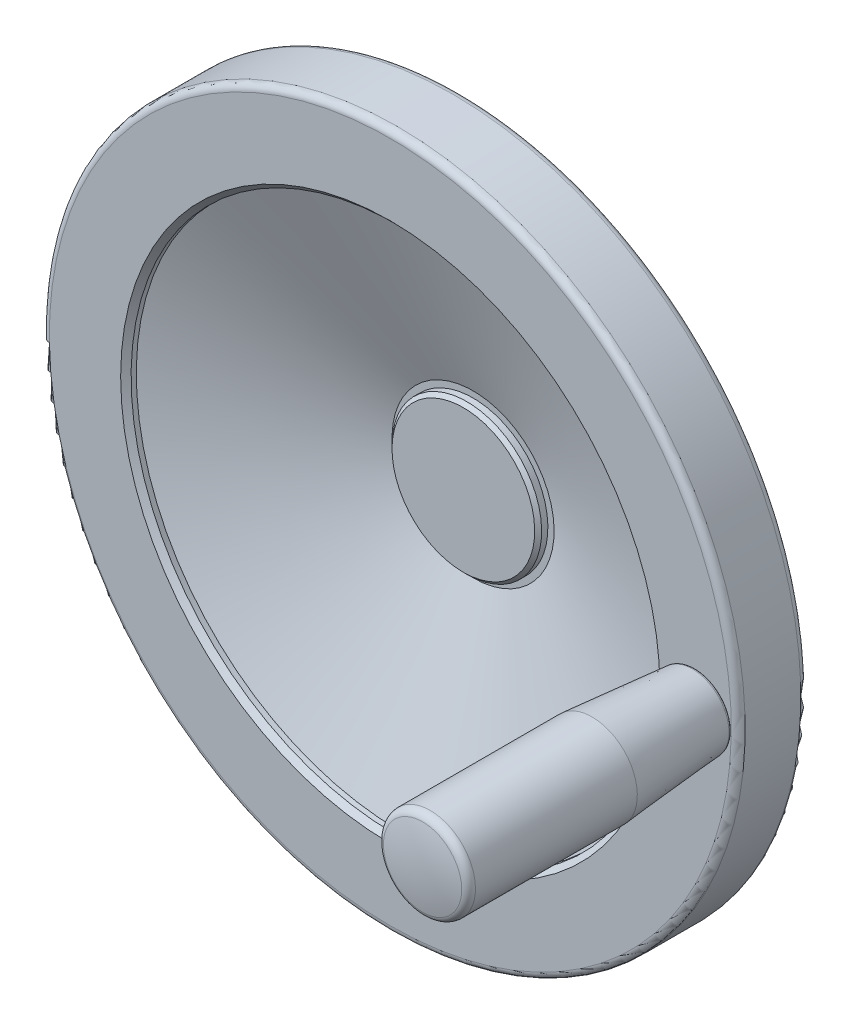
ISO-10303-21;
HEADER;
FILE_DESCRIPTION(('STEP AP214'),'2;1');
FILE_NAME('part.step','',(''),(''),'','','');
FILE_SCHEMA(('AUTOMOTIVE_DESIGN { 1 0 10303 214 1 1 1 1 }'));
ENDSEC;
DATA;
#1=APPLICATION_CONTEXT('core data for automotive mechanical design processes');
#2=APPLICATION_PROTOCOL_DEFINITION('international standard','automotive_design',2000,#1);
#3=PRODUCT_CONTEXT('',#1,'mechanical');
#4=PRODUCT('Part','Part','',(#3));
#5=PRODUCT_RELATED_PRODUCT_CATEGORY('part','',(#4));
#6=PRODUCT_DEFINITION_FORMATION('','',#4);
#7=PRODUCT_DEFINITION_CONTEXT('part definition',#1,'design');
#8=PRODUCT_DEFINITION('design','',#6,#7);
#9=PRODUCT_DEFINITION_SHAPE('','',#8);
#10=(LENGTH_UNIT() NAMED_UNIT(*) SI_UNIT(.MILLI.,.METRE.));
#11=(NAMED_UNIT(*) PLANE_ANGLE_UNIT() SI_UNIT($,.RADIAN.));
#12=(NAMED_UNIT(*) SI_UNIT($,.STERADIAN.) SOLID_ANGLE_UNIT());
#13=UNCERTAINTY_MEASURE_WITH_UNIT(LENGTH_MEASURE(1.E-05),#10,'distance_accuracy_value','');
#14=(GEOMETRIC_REPRESENTATION_CONTEXT(3) GLOBAL_UNCERTAINTY_ASSIGNED_CONTEXT((#13)) GLOBAL_UNIT_ASSIGNED_CONTEXT((#10,
#11,#12)) REPRESENTATION_CONTEXT('',''));
#15=CARTESIAN_POINT('',(0.,0.,0.));
#16=DIRECTION('',(0.,0.,1.));
#17=DIRECTION('',(1.,0.,0.));
#18=AXIS2_PLACEMENT_3D('',#15,#16,#17);
#19=CARTESIAN_POINT('',(0.,0.,54.));
#20=DIRECTION('',(0.,0.,1.));
#21=DIRECTION('',(0.,-1.,0.));
#22=AXIS2_PLACEMENT_3D('',#19,#20,#21);
#23=CONICAL_SURFACE('',#22,76.0000000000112,1.1950442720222);
#24=CARTESIAN_POINT('',(0.,0.,33.2042442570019));
#25=DIRECTION('',(0.,0.,1.));
#26=DIRECTION('',(0.,-1.,0.));
#27=AXIS2_PLACEMENT_3D('',#24,#25,#26);
#28=CIRCLE('',#27,23.2851773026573);
#29=CARTESIAN_POINT('',(0.,-23.2851773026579,33.2042442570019));
#30=VERTEX_POINT('',#29);
#31=EDGE_CURVE('E9',#30,#30,#28,.T.);
#32=CARTESIAN_POINT('',(0.,0.,54.));
#33=DIRECTION('',(0.,0.,1.));
#34=DIRECTION('',(0.,-1.,0.));
#35=AXIS2_PLACEMENT_3D('',#32,#33,#34);
#36=CIRCLE('',#35,76.0000000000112);
#37=CARTESIAN_POINT('',(0.,-76.0000000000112,54.));
#38=VERTEX_POINT('',#37);
#39=EDGE_CURVE('E59',#38,#38,#36,.T.);
#40=CARTESIAN_POINT('',(0.,-23.2851773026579,33.2042442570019));
#41=CARTESIAN_POINT('',(0.,-23.8342900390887,33.4208667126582));
#42=CARTESIAN_POINT('',(0.,-24.3834027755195,33.6374891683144));
#43=CARTESIAN_POINT('',(0.,-25.481628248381,34.0707340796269));
#44=CARTESIAN_POINT('',(0.,-26.0307409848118,34.2873565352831));
#45=CARTESIAN_POINT('',(0.,-27.1289664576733,34.7206014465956));
#46=CARTESIAN_POINT('',(0.,-27.678079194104,34.9372239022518));
#47=CARTESIAN_POINT('',(0.,-28.7763046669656,35.3704688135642));
#48=CARTESIAN_POINT('',(0.,-29.3254174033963,35.5870912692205));
#49=CARTESIAN_POINT('',(0.,-30.4236428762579,36.0203361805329));
#50=CARTESIAN_POINT('',(0.,-30.9727556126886,36.2369586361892));
#51=CARTESIAN_POINT('',(0.,-32.0709810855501,36.6702035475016));
#52=CARTESIAN_POINT('',(0.,-32.6200938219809,36.8868260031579));
#53=CARTESIAN_POINT('',(0.,-33.7183192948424,37.3200709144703));
#54=CARTESIAN_POINT('',(0.,-34.2674320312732,37.5366933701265));
#55=CARTESIAN_POINT('',(0.,-35.3656575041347,37.969938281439));
#56=CARTESIAN_POINT('',(0.,-35.9147702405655,38.1865607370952));
#57=CARTESIAN_POINT('',(0.,-37.012995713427,38.6198056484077));
#58=CARTESIAN_POINT('',(0.,-37.5621084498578,38.8364281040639));
#59=CARTESIAN_POINT('',(0.,-38.6603339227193,39.2696730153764));
#60=CARTESIAN_POINT('',(0.,-39.2094466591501,39.4862954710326));
#61=CARTESIAN_POINT('',(0.,-40.3076721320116,39.9195403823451));
#62=CARTESIAN_POINT('',(0.,-40.8567848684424,40.1361628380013));
#63=CARTESIAN_POINT('',(0.,-41.9550103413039,40.5694077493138));
#64=CARTESIAN_POINT('',(0.,-42.5041230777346,40.78603020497));
#65=CARTESIAN_POINT('',(0.,-43.6023485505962,41.2192751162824));
#66=CARTESIAN_POINT('',(0.,-44.1514612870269,41.4358975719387));
#67=CARTESIAN_POINT('',(0.,-45.2496867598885,41.8691424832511));
#68=CARTESIAN_POINT('',(0.,-45.7987994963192,42.0857649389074));
#69=CARTESIAN_POINT('',(0.,-46.8970249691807,42.5190098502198));
#70=CARTESIAN_POINT('',(0.,-47.4461377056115,42.7356323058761));
#71=CARTESIAN_POINT('',(0.,-48.544363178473,43.1688772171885));
#72=CARTESIAN_POINT('',(0.,-49.0934759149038,43.3854996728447));
#73=CARTESIAN_POINT('',(0.,-50.1917013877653,43.8187445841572));
#74=CARTESIAN_POINT('',(0.,-50.7408141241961,44.0353670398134));
#75=CARTESIAN_POINT('',(0.,-51.8390395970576,44.4686119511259));
#76=CARTESIAN_POINT('',(0.,-52.3881523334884,44.6852344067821));
#77=CARTESIAN_POINT('',(0.,-53.4863778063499,45.1184793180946));
#78=CARTESIAN_POINT('',(0.,-54.0354905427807,45.3351017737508));
#79=CARTESIAN_POINT('',(0.,-55.1337160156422,45.7683466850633));
#80=CARTESIAN_POINT('',(0.,-55.682828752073,45.9849691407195));
#81=CARTESIAN_POINT('',(0.,-56.7810542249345,46.418214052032));
#82=CARTESIAN_POINT('',(0.,-57.3301669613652,46.6348365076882));
#83=CARTESIAN_POINT('',(0.,-58.4283924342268,47.0680814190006));
#84=CARTESIAN_POINT('',(0.,-58.9775051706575,47.2847038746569));
#85=CARTESIAN_POINT('',(0.,-60.0757306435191,47.7179487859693));
#86=CARTESIAN_POINT('',(0.,-60.6248433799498,47.9345712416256));
#87=CARTESIAN_POINT('',(0.,-61.7230688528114,48.367816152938));
#88=CARTESIAN_POINT('',(0.,-62.2721815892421,48.5844386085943));
#89=CARTESIAN_POINT('',(0.,-63.3704070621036,49.0176835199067));
#90=CARTESIAN_POINT('',(0.,-63.9195197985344,49.2343059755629));
#91=CARTESIAN_POINT('',(0.,-65.0177452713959,49.6675508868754));
#92=CARTESIAN_POINT('',(0.,-65.5668580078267,49.8841733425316));
#93=CARTESIAN_POINT('',(0.,-66.6650834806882,50.3174182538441));
#94=CARTESIAN_POINT('',(0.,-67.214196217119,50.5340407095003));
#95=CARTESIAN_POINT('',(0.,-68.3124216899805,50.9672856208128));
#96=CARTESIAN_POINT('',(0.,-68.8615344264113,51.183908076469));
#97=CARTESIAN_POINT('',(0.,-69.9597598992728,51.6171529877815));
#98=CARTESIAN_POINT('',(0.,-70.5088726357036,51.8337754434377));
#99=CARTESIAN_POINT('',(0.,-71.6070981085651,52.2670203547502));
#100=CARTESIAN_POINT('',(0.,-72.1562108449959,52.4836428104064));
#101=CARTESIAN_POINT('',(0.,-73.2544363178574,52.9168877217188));
#102=CARTESIAN_POINT('',(0.,-73.8035490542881,53.1335101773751));
#103=CARTESIAN_POINT('',(0.,-74.9017745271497,53.5667550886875));
#104=CARTESIAN_POINT('',(0.,-75.4508872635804,53.7833775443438));
#105=CARTESIAN_POINT('',(0.,-76.0000000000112,54.));
#106=B_SPLINE_CURVE_WITH_KNOTS('',3,(#40,#41,#42,#43,#44,#45,#46,#47,#48,#49,#50,#51,#52,#53,
#54,#55,#56,#57,#58,#59,#60,#61,#62,#63,#64,#65,#66,#67,#68,#69,#70,#71,#72,#73,#74,#75,#76,#77,
#78,#79,#80,#81,#82,#83,#84,#85,#86,#87,#88,#89,#90,#91,#92,#93,#94,#95,#96,#97,#98,#99,#100,
#101,#102,#103,#104,#105),.UNSPECIFIED.,.F.,.F.,(4,2,2,2,2,2,2,2,2,2,2,2,2,2,2,2,2,2,2,2,2,2,2,
2,2,2,2,2,2,2,2,2,4),(0.,1.77088982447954,3.54177964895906,5.31266947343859,7.08355929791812,
8.85444912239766,10.6253389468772,12.3962287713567,14.1671185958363,15.9380084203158,
17.7088982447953,19.4797880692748,21.2506778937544,23.0215677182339,24.7924575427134,
26.563347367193,28.3342371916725,30.105127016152,31.8760168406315,33.6469066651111,
35.4177964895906,37.1886863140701,38.9595761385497,40.7304659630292,42.5013557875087,
44.2722456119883,46.0431354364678,47.8140252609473,49.5849150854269,51.3558049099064,
53.1266947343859,54.8975845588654,56.668474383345),.UNSPECIFIED.);
#107=EDGE_CURVE('BSEAM14',#30,#38,#106,.T.);
#108=ORIENTED_EDGE('',*,*,#31,.F.);
#109=ORIENTED_EDGE('',*,*,#39,.T.);
#110=ORIENTED_EDGE('',*,*,#107,.T.);
#111=ORIENTED_EDGE('',*,*,#107,.F.);
#112=EDGE_LOOP('',(#108,#110,#109,#111));
#113=FACE_BOUND('',#112,.T.);
#114=ADVANCED_FACE('F14',(#113),#23,.F.);
#115=CARTESIAN_POINT('',(23.2851773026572,0.,33.2042442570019));
#116=DIRECTION('',(0.,0.,-1.));
#117=DIRECTION('',(0.,1.,0.));
#118=AXIS2_PLACEMENT_3D('',#115,#116,#117);
#119=PLANE('',#118);
#120=CARTESIAN_POINT('',(0.,0.,33.2042442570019));
#121=DIRECTION('',(0.,0.,1.));
#122=DIRECTION('',(0.,-1.,0.));
#123=AXIS2_PLACEMENT_3D('',#120,#121,#122);
#124=CIRCLE('',#123,21.500000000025);
#125=CARTESIAN_POINT('',(0.,-21.500000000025,33.2042442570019));
#126=VERTEX_POINT('',#125);
#127=EDGE_CURVE('E20',#126,#126,#124,.T.);
#128=ORIENTED_EDGE('',*,*,#127,.F.);
#129=EDGE_LOOP('',(#128));
#130=FACE_BOUND('',#129,.T.);
#131=ORIENTED_EDGE('',*,*,#31,.T.);
#132=EDGE_LOOP('',(#131));
#133=FACE_BOUND('',#132,.T.);
#134=ADVANCED_FACE('F50',(#130,#133),#119,.F.);
#135=CARTESIAN_POINT('',(0.,0.,72.));
#136=DIRECTION('',(0.,0.,1.));
#137=DIRECTION('',(0.,-1.,0.));
#138=AXIS2_PLACEMENT_3D('',#135,#136,#137);
#139=CYLINDRICAL_SURFACE('',#138,21.500000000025);
#140=CARTESIAN_POINT('',(0.,0.,35.));
#141=DIRECTION('',(0.,0.,1.));
#142=DIRECTION('',(0.,-1.,0.));
#143=AXIS2_PLACEMENT_3D('',#140,#141,#142);
#144=CIRCLE('',#143,21.500000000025);
#145=CARTESIAN_POINT('',(0.,-21.500000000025,35.));
#146=VERTEX_POINT('',#145);
#147=EDGE_CURVE('E37',#146,#146,#144,.T.);
#148=ORIENTED_EDGE('',*,*,#147,.F.);
#149=EDGE_LOOP('',(#148));
#150=FACE_BOUND('',#149,.T.);
#151=ORIENTED_EDGE('',*,*,#127,.T.);
#152=EDGE_LOOP('',(#151));
#153=FACE_BOUND('',#152,.T.);
#154=ADVANCED_FACE('F48',(#150,#153),#139,.T.);
#155=CARTESIAN_POINT('',(0.,0.,36.));
#156=DIRECTION('',(0.,0.,-1.));
#157=DIRECTION('',(0.,1.,0.));
#158=AXIS2_PLACEMENT_3D('',#155,#156,#157);
#159=CONICAL_SURFACE('',#158,20.5000000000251,0.785398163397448);
#160=ORIENTED_EDGE('',*,*,#147,.T.);
#161=EDGE_LOOP('',(#160));
#162=FACE_BOUND('',#161,.T.);
#163=CARTESIAN_POINT('',(0.,0.,36.));
#164=DIRECTION('',(0.,0.,1.));
#165=DIRECTION('',(0.,-1.,0.));
#166=AXIS2_PLACEMENT_3D('',#163,#164,#165);
#167=CIRCLE('',#166,20.5000000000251);
#168=CARTESIAN_POINT('',(0.,-20.5000000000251,36.));
#169=VERTEX_POINT('',#168);
#170=EDGE_CURVE('E33',#169,#169,#167,.T.);
#171=ORIENTED_EDGE('',*,*,#170,.F.);
#172=EDGE_LOOP('',(#171));
#173=FACE_BOUND('',#172,.T.);
#174=ADVANCED_FACE('F129',(#162,#173),#159,.T.);
#175=CARTESIAN_POINT('',(20.5000000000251,0.,36.));
#176=DIRECTION('',(0.,0.,-1.));
#177=DIRECTION('',(0.,1.,0.));
#178=AXIS2_PLACEMENT_3D('',#175,#176,#177);
#179=PLANE('',#178);
#180=ORIENTED_EDGE('',*,*,#170,.T.);
#181=EDGE_LOOP('',(#180));
#182=FACE_BOUND('',#181,.T.);
#183=ADVANCED_FACE('F27',(#182),#179,.F.);
#184=CARTESIAN_POINT('',(0.,0.,15.));
#185=DIRECTION('',(0.,0.,-1.));
#186=DIRECTION('',(0.,1.,0.));
#187=AXIS2_PLACEMENT_3D('',#184,#185,#186);
#188=CONICAL_SURFACE('',#187,3.00000000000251,1.04719755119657);
#189=CARTESIAN_POINT('',(0.,0.,16.73205080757));
#190=VERTEX_POINT('',#189);
#191=VERTEX_LOOP('',#190);
#192=FACE_BOUND('',#191,.T.);
#193=CARTESIAN_POINT('',(0.,0.,15.));
#194=DIRECTION('',(0.,0.,1.));
#195=DIRECTION('',(0.,-1.,0.));
#196=AXIS2_PLACEMENT_3D('',#193,#194,#195);
#197=CIRCLE('',#196,3.00000000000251);
#198=CARTESIAN_POINT('',(0.,-3.00000000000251,15.));
#199=VERTEX_POINT('',#198);
#200=EDGE_CURVE('E31',#199,#199,#197,.T.);
#201=ORIENTED_EDGE('',*,*,#200,.F.);
#202=EDGE_LOOP('',(#201));
#203=FACE_BOUND('',#202,.T.);
#204=ADVANCED_FACE('F23',(#192,#203),#188,.F.);
#205=CARTESIAN_POINT('',(0.,0.,72.));
#206=DIRECTION('',(0.,0.,1.));
#207=DIRECTION('',(0.,-1.,0.));
#208=AXIS2_PLACEMENT_3D('',#205,#206,#207);
#209=CYLINDRICAL_SURFACE('',#208,3.00000000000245);
#210=ORIENTED_EDGE('',*,*,#200,.T.);
#211=EDGE_LOOP('',(#210));
#212=FACE_BOUND('',#211,.T.);
#213=CARTESIAN_POINT('',(0.,0.,0.));
#214=DIRECTION('',(0.,0.,1.));
#215=DIRECTION('',(0.,-1.,0.));
#216=AXIS2_PLACEMENT_3D('',#213,#214,#215);
#217=CIRCLE('',#216,3.00000000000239);
#218=CARTESIAN_POINT('',(0.,-3.00000000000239,0.));
#219=VERTEX_POINT('',#218);
#220=EDGE_CURVE('E34',#219,#219,#217,.T.);
#221=ORIENTED_EDGE('',*,*,#220,.F.);
#222=EDGE_LOOP('',(#221));
#223=FACE_BOUND('',#222,.T.);
#224=ADVANCED_FACE('F26',(#212,#223),#209,.F.);
#225=CARTESIAN_POINT('',(20.0000000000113,0.,0.));
#226=DIRECTION('',(0.,0.,-1.));
#227=DIRECTION('',(0.,1.,0.));
#228=AXIS2_PLACEMENT_3D('',#225,#226,#227);
#229=PLANE('',#228);
#230=ORIENTED_EDGE('',*,*,#220,.T.);
#231=EDGE_LOOP('',(#230));
#232=FACE_BOUND('',#231,.T.);
#233=CARTESIAN_POINT('',(0.,0.,0.));
#234=DIRECTION('',(0.,0.,1.));
#235=DIRECTION('',(0.,-1.,0.));
#236=AXIS2_PLACEMENT_3D('',#233,#234,#235);
#237=CIRCLE('',#236,20.0000000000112);
#238=CARTESIAN_POINT('',(0.,-20.0000000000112,0.));
#239=VERTEX_POINT('',#238);
#240=EDGE_CURVE('E40',#239,#239,#237,.T.);
#241=ORIENTED_EDGE('',*,*,#240,.F.);
#242=EDGE_LOOP('',(#241));
#243=FACE_BOUND('',#242,.T.);
#244=ADVANCED_FACE('F111',(#232,#243),#229,.T.);
#245=CARTESIAN_POINT('',(0.,0.,0.));
#246=DIRECTION('',(0.,0.,1.));
#247=DIRECTION('',(0.,-1.,0.));
#248=AXIS2_PLACEMENT_3D('',#245,#246,#247);
#249=CONICAL_SURFACE('',#248,20.0000000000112,0.785398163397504);
#250=CARTESIAN_POINT('',(0.,0.,1.50000000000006));
#251=DIRECTION('',(0.,0.,1.));
#252=DIRECTION('',(0.,-1.,0.));
#253=AXIS2_PLACEMENT_3D('',#250,#251,#252);
#254=CIRCLE('',#253,21.5000000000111);
#255=CARTESIAN_POINT('',(0.,-21.5000000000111,1.50000000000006));
#256=VERTEX_POINT('',#255);
#257=EDGE_CURVE('E104',#256,#256,#254,.T.);
#258=ORIENTED_EDGE('',*,*,#257,.F.);
#259=EDGE_LOOP('',(#258));
#260=FACE_BOUND('',#259,.T.);
#261=ORIENTED_EDGE('',*,*,#240,.T.);
#262=EDGE_LOOP('',(#261));
#263=FACE_BOUND('',#262,.T.);
#264=ADVANCED_FACE('F109',(#260,#263),#249,.T.);
#265=CARTESIAN_POINT('',(0.,0.,72.));
#266=DIRECTION('',(0.,0.,1.));
#267=DIRECTION('',(0.,-1.,0.));
#268=AXIS2_PLACEMENT_3D('',#265,#266,#267);
#269=CYLINDRICAL_SURFACE('',#268,21.5000000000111);
#270=CARTESIAN_POINT('',(0.,0.,21.6));
#271=DIRECTION('',(0.,0.,1.));
#272=DIRECTION('',(0.,-1.,0.));
#273=AXIS2_PLACEMENT_3D('',#270,#271,#272);
#274=CIRCLE('',#273,21.5000000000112);
#275=CARTESIAN_POINT('',(0.,-21.5000000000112,21.6));
#276=VERTEX_POINT('',#275);
#277=EDGE_CURVE('E101',#276,#276,#274,.T.);
#278=ORIENTED_EDGE('',*,*,#277,.F.);
#279=EDGE_LOOP('',(#278));
#280=FACE_BOUND('',#279,.T.);
#281=ORIENTED_EDGE('',*,*,#257,.T.);
#282=EDGE_LOOP('',(#281));
#283=FACE_BOUND('',#282,.T.);
#284=ADVANCED_FACE('F121',(#280,#283),#269,.T.);
#285=CARTESIAN_POINT('',(0.,0.,21.6));
#286=DIRECTION('',(0.,0.,1.));
#287=DIRECTION('',(0.,-1.,0.));
#288=AXIS2_PLACEMENT_3D('',#285,#286,#287);
#289=TOROIDAL_SURFACE('',#288,21.9000000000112,0.399999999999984);
#290=ORIENTED_EDGE('',*,*,#277,.T.);
#291=EDGE_LOOP('',(#290));
#292=FACE_BOUND('',#291,.T.);
#293=CARTESIAN_POINT('',(0.,0.,22.));
#294=DIRECTION('',(0.,0.,1.));
#295=DIRECTION('',(0.,-1.,0.));
#296=AXIS2_PLACEMENT_3D('',#293,#294,#295);
#297=CIRCLE('',#296,21.9000000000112);
#298=CARTESIAN_POINT('',(0.,-21.9000000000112,22.));
#299=VERTEX_POINT('',#298);
#300=EDGE_CURVE('E98',#299,#299,#297,.T.);
#301=ORIENTED_EDGE('',*,*,#300,.F.);
#302=EDGE_LOOP('',(#301));
#303=FACE_BOUND('',#302,.T.);
#304=ADVANCED_FACE('F203',(#292,#303),#289,.F.);
#305=CARTESIAN_POINT('',(23.5000000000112,0.,22.));
#306=DIRECTION('',(0.,0.,-1.));
#307=DIRECTION('',(0.,1.,0.));
#308=AXIS2_PLACEMENT_3D('',#305,#306,#307);
#309=PLANE('',#308);
#310=ORIENTED_EDGE('',*,*,#300,.T.);
#311=EDGE_LOOP('',(#310));
#312=FACE_BOUND('',#311,.T.);
#313=CARTESIAN_POINT('',(0.,0.,22.));
#314=DIRECTION('',(0.,0.,1.));
#315=DIRECTION('',(0.,-1.,0.));
#316=AXIS2_PLACEMENT_3D('',#313,#314,#315);
#317=CIRCLE('',#316,23.5000000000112);
#318=CARTESIAN_POINT('',(0.,-23.5000000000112,22.));
#319=VERTEX_POINT('',#318);
#320=EDGE_CURVE('E95',#319,#319,#317,.T.);
#321=ORIENTED_EDGE('',*,*,#320,.F.);
#322=EDGE_LOOP('',(#321));
#323=FACE_BOUND('',#322,.T.);
#324=ADVANCED_FACE('F210',(#312,#323),#309,.T.);
#325=CARTESIAN_POINT('',(0.,0.,72.));
#326=DIRECTION('',(0.,0.,1.));
#327=DIRECTION('',(0.,-1.,0.));
#328=AXIS2_PLACEMENT_3D('',#325,#326,#327);
#329=CYLINDRICAL_SURFACE('',#328,23.5000000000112);
#330=CARTESIAN_POINT('',(0.,0.,22.0271138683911));
#331=DIRECTION('',(0.,0.,1.));
#332=DIRECTION('',(0.,-1.,0.));
#333=AXIS2_PLACEMENT_3D('',#330,#331,#332);
#334=CIRCLE('',#333,23.5000000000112);
#335=CARTESIAN_POINT('',(0.,-23.5000000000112,22.0271138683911));
#336=VERTEX_POINT('',#335);
#337=EDGE_CURVE('E92',#336,#336,#334,.T.);
#338=ORIENTED_EDGE('',*,*,#337,.F.);
#339=EDGE_LOOP('',(#338));
#340=FACE_BOUND('',#339,.T.);
#341=ORIENTED_EDGE('',*,*,#320,.T.);
#342=EDGE_LOOP('',(#341));
#343=FACE_BOUND('',#342,.T.);
#344=ADVANCED_FACE('F219',(#340,#343),#329,.T.);
#345=CARTESIAN_POINT('',(0.,0.,22.0271138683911));
#346=DIRECTION('',(0.,0.,1.));
#347=DIRECTION('',(0.,-1.,0.));
#348=AXIS2_PLACEMENT_3D('',#345,#346,#347);
#349=TOROIDAL_SURFACE('',#348,28.5000000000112,5.);
#350=ORIENTED_EDGE('',*,*,#337,.T.);
#351=EDGE_LOOP('',(#350));
#352=FACE_BOUND('',#351,.T.);
#353=CARTESIAN_POINT('',(0.,0.,26.633698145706));
#354=DIRECTION('',(0.,0.,1.));
#355=DIRECTION('',(0.,-1.,0.));
#356=AXIS2_PLACEMENT_3D('',#353,#354,#355);
#357=CIRCLE('',#356,26.5559369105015);
#358=CARTESIAN_POINT('',(0.,-26.5559369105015,26.633698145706));
#359=VERTEX_POINT('',#358);
#360=EDGE_CURVE('E89',#359,#359,#357,.T.);
#361=ORIENTED_EDGE('',*,*,#360,.F.);
#362=EDGE_LOOP('',(#361));
#363=FACE_BOUND('',#362,.T.);
#364=ADVANCED_FACE('F228',(#352,#363),#349,.F.);
#365=CARTESIAN_POINT('',(0.,0.,26.633698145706));
#366=DIRECTION('',(0.,0.,1.));
#367=DIRECTION('',(0.,-1.,0.));
#368=AXIS2_PLACEMENT_3D('',#365,#366,#367);
#369=CONICAL_SURFACE('',#368,26.5559369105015,1.1714538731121);
#370=CARTESIAN_POINT('',(0.,0.,37.));
#371=DIRECTION('',(0.,0.,1.));
#372=DIRECTION('',(0.,-1.,0.));
#373=AXIS2_PLACEMENT_3D('',#370,#371,#372);
#374=CIRCLE('',#373,51.1195652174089);
#375=CARTESIAN_POINT('',(0.,-51.1195652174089,37.));
#376=VERTEX_POINT('',#375);
#377=EDGE_CURVE('E86',#376,#376,#374,.T.);
#378=ORIENTED_EDGE('',*,*,#377,.F.);
#379=EDGE_LOOP('',(#378));
#380=FACE_BOUND('',#379,.T.);
#381=ORIENTED_EDGE('',*,*,#360,.T.);
#382=EDGE_LOOP('',(#381));
#383=FACE_BOUND('',#382,.T.);
#384=ADVANCED_FACE('F237',(#380,#383),#369,.T.);
#385=CARTESIAN_POINT('',(98.000000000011,0.,37.));
#386=DIRECTION('',(0.,0.,-1.));
#387=DIRECTION('',(0.,1.,0.));
#388=AXIS2_PLACEMENT_3D('',#385,#386,#387);
#389=PLANE('',#388);
#390=ORIENTED_EDGE('',*,*,#377,.T.);
#391=EDGE_LOOP('',(#390));
#392=FACE_BOUND('',#391,.T.);
#393=CARTESIAN_POINT('',(0.,0.,37.));
#394=DIRECTION('',(0.,0.,1.));
#395=DIRECTION('',(0.,-1.,0.));
#396=AXIS2_PLACEMENT_3D('',#393,#394,#395);
#397=CIRCLE('',#396,98.0000000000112);
#398=CARTESIAN_POINT('',(0.,-98.0000000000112,37.));
#399=VERTEX_POINT('',#398);
#400=EDGE_CURVE('E83',#399,#399,#397,.T.);
#401=ORIENTED_EDGE('',*,*,#400,.F.);
#402=EDGE_LOOP('',(#401));
#403=FACE_BOUND('',#402,.T.);
#404=ADVANCED_FACE('F246',(#392,#403),#389,.T.);
#405=CARTESIAN_POINT('',(0.,0.,39.));
#406=DIRECTION('',(0.,0.,1.));
#407=DIRECTION('',(0.,-1.,0.));
#408=AXIS2_PLACEMENT_3D('',#405,#406,#407);
#409=TOROIDAL_SURFACE('',#408,98.0000000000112,2.);
#410=CARTESIAN_POINT('',(0.,0.,39.));
#411=DIRECTION('',(0.,0.,1.));
#412=DIRECTION('',(0.,-1.,0.));
#413=AXIS2_PLACEMENT_3D('',#410,#411,#412);
#414=CIRCLE('',#413,100.000000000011);
#415=CARTESIAN_POINT('',(0.,-100.000000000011,39.));
#416=VERTEX_POINT('',#415);
#417=EDGE_CURVE('E80',#416,#416,#414,.T.);
#418=ORIENTED_EDGE('',*,*,#417,.F.);
#419=EDGE_LOOP('',(#418));
#420=FACE_BOUND('',#419,.T.);
#421=ORIENTED_EDGE('',*,*,#400,.T.);
#422=EDGE_LOOP('',(#421));
#423=FACE_BOUND('',#422,.T.);
#424=ADVANCED_FACE('F255',(#420,#423),#409,.T.);
#425=CARTESIAN_POINT('',(0.,0.,72.));
#426=DIRECTION('',(0.,0.,1.));
#427=DIRECTION('',(0.,-1.,0.));
#428=AXIS2_PLACEMENT_3D('',#425,#426,#427);
#429=CYLINDRICAL_SURFACE('',#428,100.000000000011);
#430=ORIENTED_EDGE('',*,*,#417,.T.);
#431=EDGE_LOOP('',(#430));
#432=FACE_BOUND('',#431,.T.);
#433=CARTESIAN_POINT('',(0.,0.,55.));
#434=DIRECTION('',(0.,0.,1.));
#435=DIRECTION('',(0.,-1.,0.));
#436=AXIS2_PLACEMENT_3D('',#433,#434,#435);
#437=CIRCLE('',#436,100.000000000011);
#438=CARTESIAN_POINT('',(0.,-100.000000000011,55.));
#439=VERTEX_POINT('',#438);
#440=EDGE_CURVE('E77',#439,#439,#437,.T.);
#441=ORIENTED_EDGE('',*,*,#440,.F.);
#442=EDGE_LOOP('',(#441));
#443=FACE_BOUND('',#442,.T.);
#444=ADVANCED_FACE('F264',(#432,#443),#429,.T.);
#445=CARTESIAN_POINT('',(0.,0.,55.));
#446=DIRECTION('',(0.,0.,1.));
#447=DIRECTION('',(0.,-1.,0.));
#448=AXIS2_PLACEMENT_3D('',#445,#446,#447);
#449=TOROIDAL_SURFACE('',#448,98.0000000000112,2.);
#450=CARTESIAN_POINT('',(0.,0.,57.));
#451=DIRECTION('',(0.,0.,1.));
#452=DIRECTION('',(0.,-1.,0.));
#453=AXIS2_PLACEMENT_3D('',#450,#451,#452);
#454=CIRCLE('',#453,98.0000000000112);
#455=CARTESIAN_POINT('',(0.,-98.0000000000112,57.));
#456=VERTEX_POINT('',#455);
#457=EDGE_CURVE('E74',#456,#456,#454,.T.);
#458=ORIENTED_EDGE('',*,*,#457,.F.);
#459=EDGE_LOOP('',(#458));
#460=FACE_BOUND('',#459,.T.);
#461=ORIENTED_EDGE('',*,*,#440,.T.);
#462=EDGE_LOOP('',(#461));
#463=FACE_BOUND('',#462,.T.);
#464=ADVANCED_FACE('F273',(#460,#463),#449,.T.);
#465=CARTESIAN_POINT('',(98.000000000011,0.,57.));
#466=DIRECTION('',(0.,0.,-1.));
#467=DIRECTION('',(0.,1.,0.));
#468=AXIS2_PLACEMENT_3D('',#465,#466,#467);
#469=PLANE('',#468);
#470=CARTESIAN_POINT('',(87.9971754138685,0.,57.));
#471=DIRECTION('',(0.,0.,1.));
#472=DIRECTION('',(0.,-1.,0.));
#473=AXIS2_PLACEMENT_3D('',#470,#471,#472);
#474=CIRCLE('',#473,6.00000000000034);
#475=CARTESIAN_POINT('',(87.9971754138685,-6.00000000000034,57.));
#476=VERTEX_POINT('',#475);
#477=EDGE_CURVE('E62',#476,#476,#474,.T.);
#478=ORIENTED_EDGE('',*,*,#477,.F.);
#479=EDGE_LOOP('',(#478));
#480=FACE_BOUND('',#479,.T.);
#481=CARTESIAN_POINT('',(0.,0.,57.));
#482=DIRECTION('',(0.,0.,1.));
#483=DIRECTION('',(0.,-1.,0.));
#484=AXIS2_PLACEMENT_3D('',#481,#482,#483);
#485=CIRCLE('',#484,77.5000000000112);
#486=CARTESIAN_POINT('',(0.,-77.5000000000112,57.));
#487=VERTEX_POINT('',#486);
#488=EDGE_CURVE('E65',#487,#487,#485,.T.);
#489=ORIENTED_EDGE('',*,*,#488,.F.);
#490=EDGE_LOOP('',(#489));
#491=FACE_BOUND('',#490,.T.);
#492=ORIENTED_EDGE('',*,*,#457,.T.);
#493=EDGE_LOOP('',(#492));
#494=FACE_BOUND('',#493,.T.);
#495=ADVANCED_FACE('F282',(#480,#491,#494),#469,.F.);
#496=CARTESIAN_POINT('',(0.,0.,55.5));
#497=DIRECTION('',(0.,0.,1.));
#498=DIRECTION('',(0.,-1.,0.));
#499=AXIS2_PLACEMENT_3D('',#496,#497,#498);
#500=CONICAL_SURFACE('',#499,76.0000000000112,0.785398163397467);
#501=ORIENTED_EDGE('',*,*,#488,.T.);
#502=EDGE_LOOP('',(#501));
#503=FACE_BOUND('',#502,.T.);
#504=CARTESIAN_POINT('',(0.,0.,55.5));
#505=DIRECTION('',(0.,0.,1.));
#506=DIRECTION('',(0.,-1.,0.));
#507=AXIS2_PLACEMENT_3D('',#504,#505,#506);
#508=CIRCLE('',#507,76.0000000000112);
#509=CARTESIAN_POINT('',(0.,-76.0000000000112,55.5));
#510=VERTEX_POINT('',#509);
#511=EDGE_CURVE('E61',#510,#510,#508,.T.);
#512=ORIENTED_EDGE('',*,*,#511,.F.);
#513=EDGE_LOOP('',(#512));
#514=FACE_BOUND('',#513,.T.);
#515=ADVANCED_FACE('F291',(#503,#514),#500,.F.);
#516=CARTESIAN_POINT('',(0.,0.,72.));
#517=DIRECTION('',(0.,0.,1.));
#518=DIRECTION('',(0.,-1.,0.));
#519=AXIS2_PLACEMENT_3D('',#516,#517,#518);
#520=CYLINDRICAL_SURFACE('',#519,76.0000000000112);
#521=ORIENTED_EDGE('',*,*,#39,.F.);
#522=EDGE_LOOP('',(#521));
#523=FACE_BOUND('',#522,.T.);
#524=ORIENTED_EDGE('',*,*,#511,.T.);
#525=EDGE_LOOP('',(#524));
#526=FACE_BOUND('',#525,.T.);
#527=ADVANCED_FACE('F300',(#523,#526),#520,.F.);
#528=CARTESIAN_POINT('',(87.9971754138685,0.,152.));
#529=DIRECTION('',(0.,0.,1.));
#530=DIRECTION('',(0.,-1.,0.));
#531=AXIS2_PLACEMENT_3D('',#528,#529,#530);
#532=CYLINDRICAL_SURFACE('',#531,6.00000000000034);
#533=ORIENTED_EDGE('',*,*,#477,.T.);
#534=EDGE_LOOP('',(#533));
#535=FACE_BOUND('',#534,.T.);
#536=CARTESIAN_POINT('',(87.9971754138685,0.,57.3));
#537=DIRECTION('',(0.,0.,1.));
#538=DIRECTION('',(0.,-1.,0.));
#539=AXIS2_PLACEMENT_3D('',#536,#537,#538);
#540=CIRCLE('',#539,6.00000000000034);
#541=CARTESIAN_POINT('',(87.9971754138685,-6.00000000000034,57.3));
#542=VERTEX_POINT('',#541);
#543=EDGE_CURVE('E68',#542,#542,#540,.T.);
#544=ORIENTED_EDGE('',*,*,#543,.F.);
#545=EDGE_LOOP('',(#544));
#546=FACE_BOUND('',#545,.T.);
#547=ADVANCED_FACE('F309',(#535,#546),#532,.T.);
#548=CARTESIAN_POINT('',(97.5778140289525,0.,57.3));
#549=DIRECTION('',(0.,0.,-1.));
#550=DIRECTION('',(0.,1.,0.));
#551=AXIS2_PLACEMENT_3D('',#548,#549,#550);
#552=PLANE('',#551);
#553=ORIENTED_EDGE('',*,*,#543,.T.);
#554=EDGE_LOOP('',(#553));
#555=FACE_BOUND('',#554,.T.);
#556=CARTESIAN_POINT('',(87.9971754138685,0.,57.3));
#557=DIRECTION('',(0.,0.,1.));
#558=DIRECTION('',(0.,-1.,0.));
#559=AXIS2_PLACEMENT_3D('',#556,#557,#558);
#560=CIRCLE('',#559,9.58063861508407);
#561=CARTESIAN_POINT('',(87.9971754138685,-9.58063861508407,57.3));
#562=VERTEX_POINT('',#561);
#563=EDGE_CURVE('E408',#562,#562,#560,.T.);
#564=ORIENTED_EDGE('',*,*,#563,.F.);
#565=EDGE_LOOP('',(#564));
#566=FACE_BOUND('',#565,.T.);
#567=ADVANCED_FACE('F317',(#555,#566),#552,.T.);
#568=CARTESIAN_POINT('',(87.9971754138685,0.,58.3));
#569=DIRECTION('',(0.,0.,1.));
#570=DIRECTION('',(0.,-1.,0.));
#571=AXIS2_PLACEMENT_3D('',#568,#569,#570);
#572=TOROIDAL_SURFACE('',#571,9.58063861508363,0.999999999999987);
#573=CARTESIAN_POINT('',(87.9971754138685,0.,58.2161215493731));
#574=DIRECTION('',(0.,0.,1.));
#575=DIRECTION('',(0.,-1.,0.));
#576=AXIS2_PLACEMENT_3D('',#573,#574,#575);
#577=CIRCLE('',#576,10.5771146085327);
#578=CARTESIAN_POINT('',(87.9971754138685,-10.5771146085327,58.2161215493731));
#579=VERTEX_POINT('',#578);
#580=EDGE_CURVE('E405',#579,#579,#577,.T.);
#581=ORIENTED_EDGE('',*,*,#580,.F.);
#582=EDGE_LOOP('',(#581));
#583=FACE_BOUND('',#582,.T.);
#584=ORIENTED_EDGE('',*,*,#563,.T.);
#585=EDGE_LOOP('',(#584));
#586=FACE_BOUND('',#585,.T.);
#587=ADVANCED_FACE('F326',(#583,#586),#572,.T.);
#588=CARTESIAN_POINT('',(87.9971754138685,0.,58.2161215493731));
#589=DIRECTION('',(0.,0.,1.));
#590=DIRECTION('',(0.,-1.,0.));
#591=AXIS2_PLACEMENT_3D('',#588,#589,#590);
#592=CONICAL_SURFACE('',#591,10.5771146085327,0.0839771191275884);
#593=CARTESIAN_POINT('',(87.9971754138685,0.,87.));
#594=DIRECTION('',(0.,0.,1.));
#595=DIRECTION('',(0.,-1.,0.));
#596=AXIS2_PLACEMENT_3D('',#593,#594,#595);
#597=CIRCLE('',#596,12.9999999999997);
#598=CARTESIAN_POINT('',(87.9971754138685,-12.9999999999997,87.));
#599=VERTEX_POINT('',#598);
#600=EDGE_CURVE('E400',#599,#599,#597,.T.);
#601=ORIENTED_EDGE('',*,*,#600,.F.);
#602=EDGE_LOOP('',(#601));
#603=FACE_BOUND('',#602,.T.);
#604=ORIENTED_EDGE('',*,*,#580,.T.);
#605=EDGE_LOOP('',(#604));
#606=FACE_BOUND('',#605,.T.);
#607=ADVANCED_FACE('F335',(#603,#606),#592,.T.);
#608=CARTESIAN_POINT('',(87.9971754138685,0.,152.));
#609=DIRECTION('',(0.,0.,1.));
#610=DIRECTION('',(0.,-1.,0.));
#611=AXIS2_PLACEMENT_3D('',#608,#609,#610);
#612=CYLINDRICAL_SURFACE('',#611,12.9999999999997);
#613=ORIENTED_EDGE('',*,*,#600,.T.);
#614=EDGE_LOOP('',(#613));
#615=FACE_BOUND('',#614,.T.);
#616=CARTESIAN_POINT('',(87.9971754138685,0.,133.524187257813));
#617=DIRECTION('',(0.,0.,1.));
#618=DIRECTION('',(0.,-1.,0.));
#619=AXIS2_PLACEMENT_3D('',#616,#617,#618);
#620=CIRCLE('',#619,12.9999999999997);
#621=CARTESIAN_POINT('',(87.9971754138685,-12.9999999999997,133.524187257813));
#622=VERTEX_POINT('',#621);
#623=EDGE_CURVE('E397',#622,#622,#620,.T.);
#624=ORIENTED_EDGE('',*,*,#623,.F.);
#625=EDGE_LOOP('',(#624));
#626=FACE_BOUND('',#625,.T.);
#627=ADVANCED_FACE('F344',(#615,#626),#612,.T.);
#628=CARTESIAN_POINT('',(87.9971754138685,0.,133.524187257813));
#629=DIRECTION('',(0.,0.,1.));
#630=DIRECTION('',(0.,-1.,0.));
#631=AXIS2_PLACEMENT_3D('',#628,#629,#630);
#632=TOROIDAL_SURFACE('',#631,10.7500000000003,2.24999999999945);
#633=CARTESIAN_POINT('',(87.9971754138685,0.,135.716426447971));
#634=DIRECTION('',(0.,0.,1.));
#635=DIRECTION('',(0.,-1.,0.));
#636=AXIS2_PLACEMENT_3D('',#633,#634,#635);
#637=CIRCLE('',#636,11.2565445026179);
#638=CARTESIAN_POINT('',(87.9971754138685,-11.2565445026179,135.716426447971));
#639=VERTEX_POINT('',#638);
#640=EDGE_CURVE('E396',#639,#639,#637,.T.);
#641=ORIENTED_EDGE('',*,*,#640,.F.);
#642=EDGE_LOOP('',(#641));
#643=FACE_BOUND('',#642,.T.);
#644=ORIENTED_EDGE('',*,*,#623,.T.);
#645=EDGE_LOOP('',(#644));
#646=FACE_BOUND('',#645,.T.);
#647=ADVANCED_FACE('F353',(#643,#646),#632,.T.);
#648=CARTESIAN_POINT('',(87.997175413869,0.,87.));
#649=DIRECTION('',(0.,-1.,0.));
#650=DIRECTION('',(0.,0.,-1.));
#651=AXIS2_PLACEMENT_3D('',#648,#649,#650);
#652=SPHERICAL_SURFACE('',#651,50.);
#653=CARTESIAN_POINT('',(87.997175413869,0.,87.));
#654=DIRECTION('',(0.,0.,1.));
#655=DIRECTION('',(0.,-1.,0.));
#656=AXIS2_PLACEMENT_3D('',#653,#654,#655);
#657=SPHERICAL_SURFACE('',#656,50.);
#658=ORIENTED_EDGE('',*,*,#640,.T.);
#659=EDGE_LOOP('',(#658));
#660=FACE_BOUND('',#659,.T.);
#661=ADVANCED_FACE('F362',(#660),#657,.T.);
#662=CLOSED_SHELL('',(#114,#134,#154,#174,#183,#204,#224,#244,#264,#284,#304,#324,#344,#364,
#384,#404,#424,#444,#464,#495,#515,#527,#547,#567,#587,#607,#627,#647,#661));
#663=MANIFOLD_SOLID_BREP('B1',#662);
#664=ADVANCED_BREP_SHAPE_REPRESENTATION('',(#18,#663),#14);
#665=SHAPE_DEFINITION_REPRESENTATION(#9,#664);
ENDSEC;
END-ISO-10303-21;
